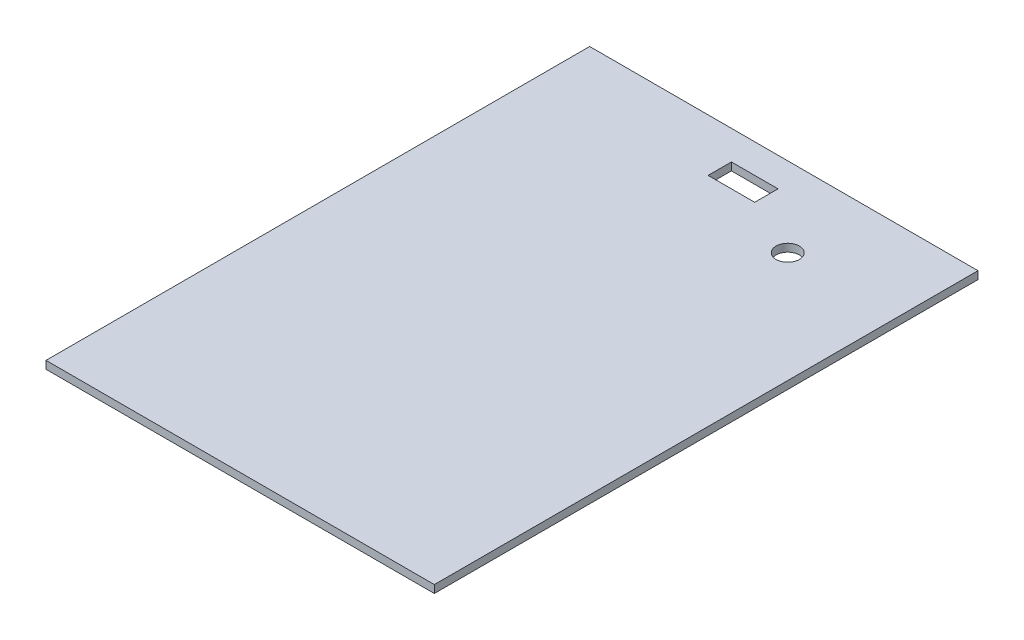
ISO-10303-21;
HEADER;
FILE_DESCRIPTION(('STEP AP214'),'2;1');
FILE_NAME('part.step','',(''),(''),'','','');
FILE_SCHEMA(('AUTOMOTIVE_DESIGN { 1 0 10303 214 1 1 1 1 }'));
ENDSEC;
DATA;
#1=APPLICATION_CONTEXT('core data for automotive mechanical design processes');
#2=APPLICATION_PROTOCOL_DEFINITION('international standard','automotive_design',2000,#1);
#3=PRODUCT_CONTEXT('',#1,'mechanical');
#4=PRODUCT('Part','Part','',(#3));
#5=PRODUCT_RELATED_PRODUCT_CATEGORY('part','',(#4));
#6=PRODUCT_DEFINITION_FORMATION('','',#4);
#7=PRODUCT_DEFINITION_CONTEXT('part definition',#1,'design');
#8=PRODUCT_DEFINITION('design','',#6,#7);
#9=PRODUCT_DEFINITION_SHAPE('','',#8);
#10=(LENGTH_UNIT() NAMED_UNIT(*) SI_UNIT(.MILLI.,.METRE.));
#11=(NAMED_UNIT(*) PLANE_ANGLE_UNIT() SI_UNIT($,.RADIAN.));
#12=(NAMED_UNIT(*) SI_UNIT($,.STERADIAN.) SOLID_ANGLE_UNIT());
#13=UNCERTAINTY_MEASURE_WITH_UNIT(LENGTH_MEASURE(1.E-05),#10,'distance_accuracy_value','');
#14=(GEOMETRIC_REPRESENTATION_CONTEXT(3) GLOBAL_UNCERTAINTY_ASSIGNED_CONTEXT((#13)) GLOBAL_UNIT_ASSIGNED_CONTEXT((#10,
#11,#12)) REPRESENTATION_CONTEXT('',''));
#15=CARTESIAN_POINT('',(0.,0.,0.));
#16=DIRECTION('',(0.,0.,1.));
#17=DIRECTION('',(1.,0.,0.));
#18=AXIS2_PLACEMENT_3D('',#15,#16,#17);
#19=CARTESIAN_POINT('',(-2.49999999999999,2.,2.5));
#20=DIRECTION('',(0.,1.,0.));
#21=DIRECTION('',(0.,0.,1.));
#22=AXIS2_PLACEMENT_3D('',#19,#20,#21);
#23=PLANE('',#22);
#24=DIRECTION('',(1.,0.,0.));
#25=VECTOR('',#24,1.);
#26=CARTESIAN_POINT('',(41.5,2.,-124.));
#27=LINE('',#26,#25);
#28=CARTESIAN_POINT('',(41.5,2.,-124.));
#29=VERTEX_POINT('',#28);
#30=CARTESIAN_POINT('',(53.5,2.,-124.));
#31=VERTEX_POINT('',#30);
#32=EDGE_CURVE('E127',#29,#31,#27,.T.);
#33=ORIENTED_EDGE('',*,*,#32,.F.);
#34=DIRECTION('',(0.,0.,1.));
#35=VECTOR('',#34,1.);
#36=CARTESIAN_POINT('',(41.5,2.,-130.));
#37=LINE('',#36,#35);
#38=CARTESIAN_POINT('',(41.5,2.,-130.));
#39=VERTEX_POINT('',#38);
#40=EDGE_CURVE('E110',#39,#29,#37,.T.);
#41=ORIENTED_EDGE('',*,*,#40,.F.);
#42=DIRECTION('',(-1.,0.,0.));
#43=VECTOR('',#42,1.);
#44=CARTESIAN_POINT('',(41.5,2.,-130.));
#45=LINE('',#44,#43);
#46=CARTESIAN_POINT('',(53.5,2.,-130.));
#47=VERTEX_POINT('',#46);
#48=EDGE_CURVE('E131',#47,#39,#45,.T.);
#49=ORIENTED_EDGE('',*,*,#48,.F.);
#50=DIRECTION('',(0.,0.,-1.));
#51=VECTOR('',#50,1.);
#52=CARTESIAN_POINT('',(53.5,2.,-130.));
#53=LINE('',#52,#51);
#54=EDGE_CURVE('E129',#31,#47,#53,.T.);
#55=ORIENTED_EDGE('',*,*,#54,.F.);
#56=EDGE_LOOP('',(#33,#41,#49,#55));
#57=FACE_BOUND('',#56,.T.);
#58=DIRECTION('',(0.,0.,1.));
#59=VECTOR('',#58,1.);
#60=CARTESIAN_POINT('',(-2.49999999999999,2.,-137.5));
#61=LINE('',#60,#59);
#62=CARTESIAN_POINT('',(-2.49999999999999,2.,-137.5));
#63=VERTEX_POINT('',#62);
#64=CARTESIAN_POINT('',(-2.49999999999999,2.,2.5));
#65=VERTEX_POINT('',#64);
#66=EDGE_CURVE('E145',#63,#65,#61,.T.);
#67=ORIENTED_EDGE('',*,*,#66,.T.);
#68=DIRECTION('',(1.,0.,0.));
#69=VECTOR('',#68,1.);
#70=CARTESIAN_POINT('',(-2.49999999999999,2.,2.5));
#71=LINE('',#70,#69);
#72=CARTESIAN_POINT('',(97.5,2.,2.5));
#73=VERTEX_POINT('',#72);
#74=EDGE_CURVE('E148',#65,#73,#71,.T.);
#75=ORIENTED_EDGE('',*,*,#74,.T.);
#76=DIRECTION('',(0.,0.,-1.));
#77=VECTOR('',#76,1.);
#78=CARTESIAN_POINT('',(97.5,2.,-137.5));
#79=LINE('',#78,#77);
#80=CARTESIAN_POINT('',(97.5,2.,-137.5));
#81=VERTEX_POINT('',#80);
#82=EDGE_CURVE('E150',#73,#81,#79,.T.);
#83=ORIENTED_EDGE('',*,*,#82,.T.);
#84=DIRECTION('',(-1.,0.,0.));
#85=VECTOR('',#84,1.);
#86=CARTESIAN_POINT('',(-2.49999999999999,2.,-137.5));
#87=LINE('',#86,#85);
#88=EDGE_CURVE('E152',#81,#63,#87,.T.);
#89=ORIENTED_EDGE('',*,*,#88,.T.);
#90=EDGE_LOOP('',(#67,#75,#83,#89));
#91=FACE_BOUND('',#90,.T.);
#92=CARTESIAN_POINT('',(69.,2.,-117.));
#93=DIRECTION('',(0.,1.,0.));
#94=DIRECTION('',(0.,0.,1.));
#95=AXIS2_PLACEMENT_3D('',#92,#93,#94);
#96=CIRCLE('',#95,3.00000000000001);
#97=CARTESIAN_POINT('',(69.,2.,-114.));
#98=VERTEX_POINT('',#97);
#99=EDGE_CURVE('E117',#98,#98,#96,.T.);
#100=ORIENTED_EDGE('',*,*,#99,.F.);
#101=EDGE_LOOP('',(#100));
#102=FACE_BOUND('',#101,.T.);
#103=ADVANCED_FACE('F30',(#57,#91,#102),#23,.T.);
#104=CARTESIAN_POINT('',(-2.49999999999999,0.,2.5));
#105=DIRECTION('',(0.,1.,0.));
#106=DIRECTION('',(0.,0.,1.));
#107=AXIS2_PLACEMENT_3D('',#104,#105,#106);
#108=PLANE('',#107);
#109=DIRECTION('',(0.,0.,1.));
#110=VECTOR('',#109,1.);
#111=CARTESIAN_POINT('',(41.5,0.,-130.));
#112=LINE('',#111,#110);
#113=CARTESIAN_POINT('',(41.5,0.,-130.));
#114=VERTEX_POINT('',#113);
#115=CARTESIAN_POINT('',(41.5,0.,-124.));
#116=VERTEX_POINT('',#115);
#117=EDGE_CURVE('E53',#114,#116,#112,.T.);
#118=ORIENTED_EDGE('',*,*,#117,.T.);
#119=DIRECTION('',(1.,0.,0.));
#120=VECTOR('',#119,1.);
#121=CARTESIAN_POINT('',(41.5,0.,-124.));
#122=LINE('',#121,#120);
#123=CARTESIAN_POINT('',(53.5,0.,-124.));
#124=VERTEX_POINT('',#123);
#125=EDGE_CURVE('E97',#116,#124,#122,.T.);
#126=ORIENTED_EDGE('',*,*,#125,.T.);
#127=DIRECTION('',(0.,0.,-1.));
#128=VECTOR('',#127,1.);
#129=CARTESIAN_POINT('',(53.5,0.,-130.));
#130=LINE('',#129,#128);
#131=CARTESIAN_POINT('',(53.5,0.,-130.));
#132=VERTEX_POINT('',#131);
#133=EDGE_CURVE('E106',#124,#132,#130,.T.);
#134=ORIENTED_EDGE('',*,*,#133,.T.);
#135=DIRECTION('',(-1.,0.,0.));
#136=VECTOR('',#135,1.);
#137=CARTESIAN_POINT('',(41.5,0.,-130.));
#138=LINE('',#137,#136);
#139=EDGE_CURVE('E116',#132,#114,#138,.T.);
#140=ORIENTED_EDGE('',*,*,#139,.T.);
#141=EDGE_LOOP('',(#118,#126,#134,#140));
#142=FACE_BOUND('',#141,.T.);
#143=DIRECTION('',(0.,0.,1.));
#144=VECTOR('',#143,1.);
#145=CARTESIAN_POINT('',(-2.49999999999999,0.,-137.5));
#146=LINE('',#145,#144);
#147=CARTESIAN_POINT('',(-2.49999999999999,0.,-137.5));
#148=VERTEX_POINT('',#147);
#149=CARTESIAN_POINT('',(-2.49999999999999,0.,2.5));
#150=VERTEX_POINT('',#149);
#151=EDGE_CURVE('E111',#148,#150,#146,.T.);
#152=ORIENTED_EDGE('',*,*,#151,.F.);
#153=DIRECTION('',(-1.,0.,0.));
#154=VECTOR('',#153,1.);
#155=CARTESIAN_POINT('',(-2.49999999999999,0.,-137.5));
#156=LINE('',#155,#154);
#157=CARTESIAN_POINT('',(97.5,0.,-137.5));
#158=VERTEX_POINT('',#157);
#159=EDGE_CURVE('E143',#158,#148,#156,.T.);
#160=ORIENTED_EDGE('',*,*,#159,.F.);
#161=DIRECTION('',(0.,0.,-1.));
#162=VECTOR('',#161,1.);
#163=CARTESIAN_POINT('',(97.5,0.,-137.5));
#164=LINE('',#163,#162);
#165=CARTESIAN_POINT('',(97.5,0.,2.5));
#166=VERTEX_POINT('',#165);
#167=EDGE_CURVE('E141',#166,#158,#164,.T.);
#168=ORIENTED_EDGE('',*,*,#167,.F.);
#169=DIRECTION('',(1.,0.,0.));
#170=VECTOR('',#169,1.);
#171=CARTESIAN_POINT('',(-2.49999999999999,0.,2.5));
#172=LINE('',#171,#170);
#173=EDGE_CURVE('E139',#150,#166,#172,.T.);
#174=ORIENTED_EDGE('',*,*,#173,.F.);
#175=EDGE_LOOP('',(#152,#160,#168,#174));
#176=FACE_BOUND('',#175,.T.);
#177=CARTESIAN_POINT('',(69.,0.,-117.));
#178=DIRECTION('',(0.,1.,0.));
#179=DIRECTION('',(0.,0.,1.));
#180=AXIS2_PLACEMENT_3D('',#177,#178,#179);
#181=CIRCLE('',#180,3.00000000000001);
#182=CARTESIAN_POINT('',(69.,0.,-114.));
#183=VERTEX_POINT('',#182);
#184=EDGE_CURVE('E120',#183,#183,#181,.T.);
#185=ORIENTED_EDGE('',*,*,#184,.T.);
#186=EDGE_LOOP('',(#185));
#187=FACE_BOUND('',#186,.T.);
#188=ADVANCED_FACE('F114',(#142,#176,#187),#108,.F.);
#189=CARTESIAN_POINT('',(-2.49999999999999,2.,-137.5));
#190=DIRECTION('',(1.,0.,0.));
#191=DIRECTION('',(0.,0.,-1.));
#192=AXIS2_PLACEMENT_3D('',#189,#190,#191);
#193=PLANE('',#192);
#194=ORIENTED_EDGE('',*,*,#151,.T.);
#195=DIRECTION('',(0.,-1.,0.));
#196=VECTOR('',#195,1.);
#197=CARTESIAN_POINT('',(-2.49999999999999,2.,2.5));
#198=LINE('',#197,#196);
#199=EDGE_CURVE('E11',#65,#150,#198,.T.);
#200=ORIENTED_EDGE('',*,*,#199,.F.);
#201=ORIENTED_EDGE('',*,*,#66,.F.);
#202=DIRECTION('',(0.,-1.,0.));
#203=VECTOR('',#202,1.);
#204=CARTESIAN_POINT('',(-2.49999999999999,2.,-137.5));
#205=LINE('',#204,#203);
#206=EDGE_CURVE('E154',#63,#148,#205,.T.);
#207=ORIENTED_EDGE('',*,*,#206,.T.);
#208=EDGE_LOOP('',(#194,#200,#201,#207));
#209=FACE_BOUND('',#208,.T.);
#210=ADVANCED_FACE('F32',(#209),#193,.F.);
#211=CARTESIAN_POINT('',(-2.49999999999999,2.,2.5));
#212=DIRECTION('',(0.,0.,-1.));
#213=DIRECTION('',(-1.,0.,0.));
#214=AXIS2_PLACEMENT_3D('',#211,#212,#213);
#215=PLANE('',#214);
#216=ORIENTED_EDGE('',*,*,#173,.T.);
#217=DIRECTION('',(0.,-1.,0.));
#218=VECTOR('',#217,1.);
#219=CARTESIAN_POINT('',(97.5,2.,2.5));
#220=LINE('',#219,#218);
#221=EDGE_CURVE('E38',#73,#166,#220,.T.);
#222=ORIENTED_EDGE('',*,*,#221,.F.);
#223=ORIENTED_EDGE('',*,*,#74,.F.);
#224=ORIENTED_EDGE('',*,*,#199,.T.);
#225=EDGE_LOOP('',(#216,#222,#223,#224));
#226=FACE_BOUND('',#225,.T.);
#227=ADVANCED_FACE('F179',(#226),#215,.F.);
#228=CARTESIAN_POINT('',(97.5,2.,-137.5));
#229=DIRECTION('',(-1.,0.,0.));
#230=DIRECTION('',(0.,0.,1.));
#231=AXIS2_PLACEMENT_3D('',#228,#229,#230);
#232=PLANE('',#231);
#233=ORIENTED_EDGE('',*,*,#167,.T.);
#234=DIRECTION('',(0.,-1.,0.));
#235=VECTOR('',#234,1.);
#236=CARTESIAN_POINT('',(97.5,2.,-137.5));
#237=LINE('',#236,#235);
#238=EDGE_CURVE('E157',#81,#158,#237,.T.);
#239=ORIENTED_EDGE('',*,*,#238,.F.);
#240=ORIENTED_EDGE('',*,*,#82,.F.);
#241=ORIENTED_EDGE('',*,*,#221,.T.);
#242=EDGE_LOOP('',(#233,#239,#240,#241));
#243=FACE_BOUND('',#242,.T.);
#244=ADVANCED_FACE('F164',(#243),#232,.F.);
#245=CARTESIAN_POINT('',(-2.49999999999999,2.,-137.5));
#246=DIRECTION('',(0.,0.,1.));
#247=DIRECTION('',(1.,0.,0.));
#248=AXIS2_PLACEMENT_3D('',#245,#246,#247);
#249=PLANE('',#248);
#250=ORIENTED_EDGE('',*,*,#159,.T.);
#251=ORIENTED_EDGE('',*,*,#206,.F.);
#252=ORIENTED_EDGE('',*,*,#88,.F.);
#253=ORIENTED_EDGE('',*,*,#238,.T.);
#254=EDGE_LOOP('',(#250,#251,#252,#253));
#255=FACE_BOUND('',#254,.T.);
#256=ADVANCED_FACE('F172',(#255),#249,.F.);
#257=CARTESIAN_POINT('',(41.5,2.,-130.));
#258=DIRECTION('',(1.,0.,0.));
#259=DIRECTION('',(0.,0.,-1.));
#260=AXIS2_PLACEMENT_3D('',#257,#258,#259);
#261=PLANE('',#260);
#262=ORIENTED_EDGE('',*,*,#117,.F.);
#263=DIRECTION('',(0.,-1.,0.));
#264=VECTOR('',#263,1.);
#265=CARTESIAN_POINT('',(41.5,2.,-130.));
#266=LINE('',#265,#264);
#267=EDGE_CURVE('E133',#39,#114,#266,.T.);
#268=ORIENTED_EDGE('',*,*,#267,.F.);
#269=ORIENTED_EDGE('',*,*,#40,.T.);
#270=DIRECTION('',(0.,-1.,0.));
#271=VECTOR('',#270,1.);
#272=CARTESIAN_POINT('',(41.5,2.,-124.));
#273=LINE('',#272,#271);
#274=EDGE_CURVE('E99',#29,#116,#273,.T.);
#275=ORIENTED_EDGE('',*,*,#274,.T.);
#276=EDGE_LOOP('',(#262,#268,#269,#275));
#277=FACE_BOUND('',#276,.T.);
#278=ADVANCED_FACE('F108',(#277),#261,.T.);
#279=CARTESIAN_POINT('',(41.5,2.,-124.));
#280=DIRECTION('',(0.,0.,-1.));
#281=DIRECTION('',(-1.,0.,0.));
#282=AXIS2_PLACEMENT_3D('',#279,#280,#281);
#283=PLANE('',#282);
#284=ORIENTED_EDGE('',*,*,#125,.F.);
#285=ORIENTED_EDGE('',*,*,#274,.F.);
#286=ORIENTED_EDGE('',*,*,#32,.T.);
#287=DIRECTION('',(0.,-1.,0.));
#288=VECTOR('',#287,1.);
#289=CARTESIAN_POINT('',(53.5,2.,-124.));
#290=LINE('',#289,#288);
#291=EDGE_CURVE('E102',#31,#124,#290,.T.);
#292=ORIENTED_EDGE('',*,*,#291,.T.);
#293=EDGE_LOOP('',(#284,#285,#286,#292));
#294=FACE_BOUND('',#293,.T.);
#295=ADVANCED_FACE('F98',(#294),#283,.T.);
#296=CARTESIAN_POINT('',(53.5,2.,-130.));
#297=DIRECTION('',(-1.,0.,0.));
#298=DIRECTION('',(0.,0.,1.));
#299=AXIS2_PLACEMENT_3D('',#296,#297,#298);
#300=PLANE('',#299);
#301=ORIENTED_EDGE('',*,*,#133,.F.);
#302=ORIENTED_EDGE('',*,*,#291,.F.);
#303=ORIENTED_EDGE('',*,*,#54,.T.);
#304=DIRECTION('',(0.,-1.,0.));
#305=VECTOR('',#304,1.);
#306=CARTESIAN_POINT('',(53.5,2.,-130.));
#307=LINE('',#306,#305);
#308=EDGE_CURVE('E45',#47,#132,#307,.T.);
#309=ORIENTED_EDGE('',*,*,#308,.T.);
#310=EDGE_LOOP('',(#301,#302,#303,#309));
#311=FACE_BOUND('',#310,.T.);
#312=ADVANCED_FACE('F202',(#311),#300,.T.);
#313=CARTESIAN_POINT('',(41.5,2.,-130.));
#314=DIRECTION('',(0.,0.,1.));
#315=DIRECTION('',(1.,0.,0.));
#316=AXIS2_PLACEMENT_3D('',#313,#314,#315);
#317=PLANE('',#316);
#318=ORIENTED_EDGE('',*,*,#139,.F.);
#319=ORIENTED_EDGE('',*,*,#308,.F.);
#320=ORIENTED_EDGE('',*,*,#48,.T.);
#321=ORIENTED_EDGE('',*,*,#267,.T.);
#322=EDGE_LOOP('',(#318,#319,#320,#321));
#323=FACE_BOUND('',#322,.T.);
#324=ADVANCED_FACE('F207',(#323),#317,.T.);
#325=CARTESIAN_POINT('',(69.,2.,-117.));
#326=DIRECTION('',(0.,-1.,0.));
#327=DIRECTION('',(0.,0.,-1.));
#328=AXIS2_PLACEMENT_3D('',#325,#326,#327);
#329=CYLINDRICAL_SURFACE('',#328,3.00000000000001);
#330=ORIENTED_EDGE('',*,*,#99,.T.);
#331=EDGE_LOOP('',(#330));
#332=FACE_BOUND('',#331,.T.);
#333=ORIENTED_EDGE('',*,*,#184,.F.);
#334=EDGE_LOOP('',(#333));
#335=FACE_BOUND('',#334,.T.);
#336=ADVANCED_FACE('F211',(#332,#335),#329,.F.);
#337=CLOSED_SHELL('',(#103,#188,#210,#227,#244,#256,#278,#295,#312,#324,#336));
#338=MANIFOLD_SOLID_BREP('B2',#337);
#339=ADVANCED_BREP_SHAPE_REPRESENTATION('',(#18,#338),#14);
#340=SHAPE_DEFINITION_REPRESENTATION(#9,#339);
ENDSEC;
END-ISO-10303-21;
